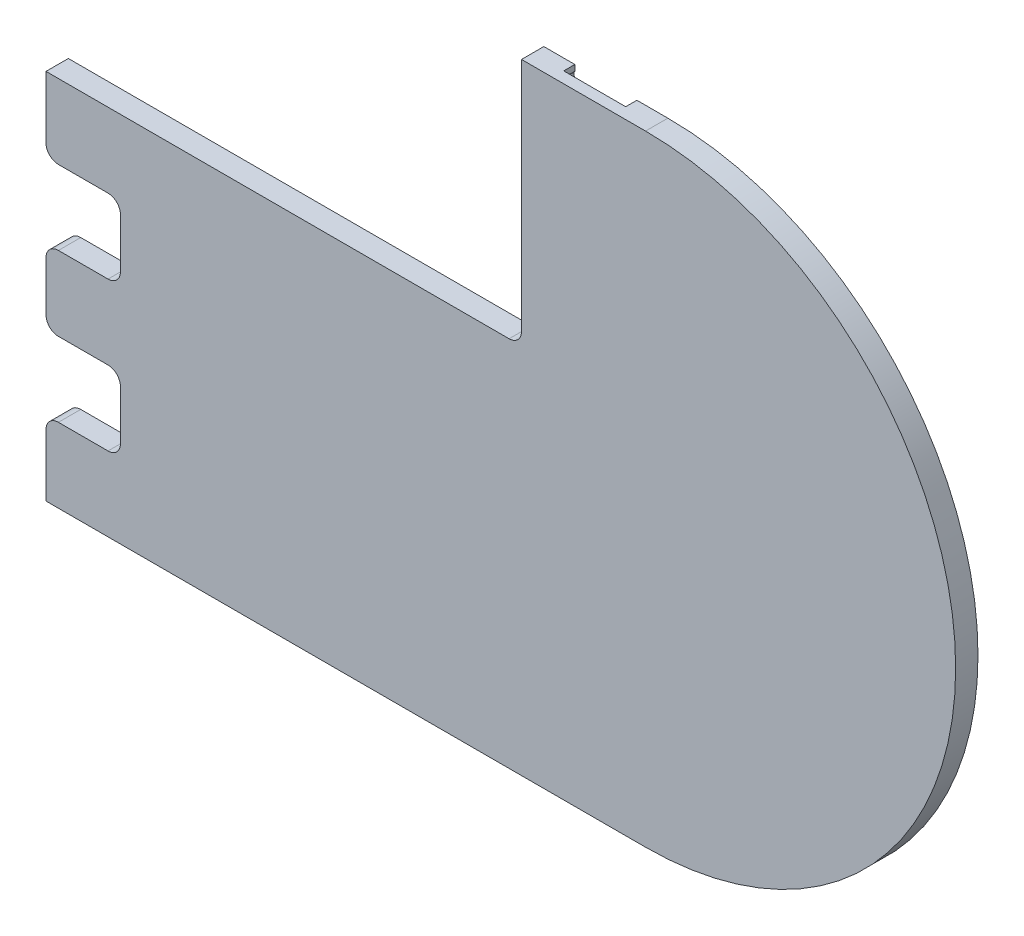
from build123d import *

# Parameters (mm, degrees)
BOSS_EXTRU_1_DEPTH           = 18
ENL_V_MAT_EXTRU_1_DEPTH      = 1129.195018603
ENL_V_MAT_EXTRU_1_DEPTH_BACK = 18
ENL_V_MAT_EXTRU_2_DEPTH      = 30
CONG_3_R                     = 10
ENL_V_MAT_EXTRU_4_DEPTH      = 9
R_P_TITION_LIN_AIRE2_COUNT   = 3
R_P_TITION_LIN_AIRE2_PITCH   = 120
CONG_1_R                     = 10
ENL_V_MAT_EXTRU_5_DEPTH      = 9
ESQUISSE10_W                 = 50
ESQUISSE10_H                 = 36
ENL_V_MAT_EXTRU_6_DEPTH      = 9


with BuildPart() as part:
    # Esquisse1 → Boss.-Extru.1 (new body)
    with BuildSketch(Plane.XY):
        with BuildLine():
            Line((-850, -250), (850, -250))
            ThreePointArc((850, -250), (1100, 0), (850, 250))
            Line((850, 250), (-850, 250))
            ThreePointArc((-850, 250), (-1100, 0), (-850, -250))
        make_face()
    extrude(amount=BOSS_EXTRU_1_DEPTH)

    # Esquisse2 → Enl_v. mat.-Extru.1 (cut, two sides: drawn at the far end of the back side and taken through both)
    with BuildSketch(Plane.XY.offset(18).offset(-ENL_V_MAT_EXTRU_1_DEPTH_BACK)):
        Polygon((-750, 4092.753579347), (-750, 250), (-750, 50), (750, 50), (750, 250), (750, 4092.753579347), (750, 11778.260738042), (-750, 11778.260738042), align=None)
    extrude(amount=ENL_V_MAT_EXTRU_1_DEPTH + ENL_V_MAT_EXTRU_1_DEPTH_BACK, mode=Mode.SUBTRACT)

    # Esquisse5 → Enl_v. mat.-Extru.2 (cut)
    with BuildSketch(Plane(origin=(0, 0, 0), x_dir=(-1, 0, 0), z_dir=(0, 0, -1))):
        Polygon((0, 50), (-366.666666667, 50), (-366.666666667, -10), (-426.666666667, -10), (-426.666666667, -70), (-366.666666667, -70), (-366.666666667, -130), (-426.666666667, -130), (-426.666666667, -190), (-366.666666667, -190), (-366.666666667, -250), (0, -250), align=None)
        Polygon((366.666666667, 50), (0, 50), (0, -250), (366.666666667, -250), (366.666666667, -190), (426.666666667, -190), (426.666666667, -130), (366.666666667, -130), (366.666666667, -70), (426.666666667, -70), (426.666666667, -10), (366.666666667, -10), align=None)
        with BuildLine():
            Line((750, 50), (366.666666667, 50))
            Line((366.666666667, 50), (366.666666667, -10))
            Line((366.666666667, -10), (426.666666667, -10))
            Line((426.666666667, -10), (426.666666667, -70))
            Line((426.666666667, -70), (366.666666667, -70))
            Line((366.666666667, -70), (366.666666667, -130))
            Line((366.666666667, -130), (426.666666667, -130))
            Line((426.666666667, -130), (426.666666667, -190))
            Line((426.666666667, -190), (366.666666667, -190))
            Line((366.666666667, -190), (366.666666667, -250))
            Line((366.666666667, -250), (850, -250))
            ThreePointArc((850, -250), (1100, 0), (850, 250))
            Line((850, 250), (750, 250))
            Line((750, 250), (750, 50))
        make_face()
    extrude(amount=-ENL_V_MAT_EXTRU_2_DEPTH, mode=Mode.SUBTRACT)

    # Cong_3
    cong_3_edges = [part.edges().sort_by_distance(p)[0] for p in [
        (366.666666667, -190, 9),
        (426.666666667, -190, 9),
        (426.666666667, -130, 9),
        (366.666666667, -130, 9),
        (366.666666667, -70, 9),
        (426.666666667, -70, 9),
        (426.666666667, -10, 9),
        (366.666666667, -10, 9),
    ]]
    fillet(cong_3_edges, radius=CONG_3_R)

    # Esquisse7 → Enl_v. mat.-Extru.4 (cut)
    with BuildSketch(Plane(origin=(0, 0, 0), x_dir=(-1, 0, 0), z_dir=(0, 0, -1))):
        with BuildLine():
            Line((-401.42402598, 8), (-391.909307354, 8))
            ThreePointArc((-391.909307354, 8), (-387.666666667, 8), (-387.666666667, 12.242640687))
            Line((-387.666666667, 12.242640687), (-387.666666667, 27.757359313))
            ThreePointArc((-387.666666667, 27.757359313), (-387.666666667, 32), (-391.909307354, 32))
            Line((-391.909307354, 32), (-401.42402598, 32))
            ThreePointArc((-401.42402598, 32), (-405.666666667, 32), (-405.666666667, 27.757359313))
            Line((-405.666666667, 27.757359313), (-405.666666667, 12.242640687))
            ThreePointArc((-405.666666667, 12.242640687), (-405.666666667, 8), (-401.42402598, 8))
        make_face()
    enl_v_mat_extru_4 = extrude(amount=-ENL_V_MAT_EXTRU_4_DEPTH, mode=Mode.SUBTRACT)

    # R_p_tition lin_aire2: Enl_v. mat.-Extru.4 ×3
    with Locations(*[(0, -i * R_P_TITION_LIN_AIRE2_PITCH, 0) for i in range(1, R_P_TITION_LIN_AIRE2_COUNT)]):
        add(enl_v_mat_extru_4, mode=Mode.SUBTRACT)

    # Cong_1
    cong_1_edges = [part.edges().sort_by_distance(p)[0] for p in [
        (750, 50, 9),
    ]]
    fillet(cong_1_edges, radius=CONG_1_R)

    # Esquisse9 → Enl_v. mat.-Extru.5 (cut)
    with BuildSketch(Plane(origin=(0, 0, 0), x_dir=(-1, 0, 0), z_dir=(0, 0, -1))):
        with BuildLine():
            Line((-825, 259), (-775, 259))
            Line((-775, 259), (-775, 245.242640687))
            ThreePointArc((-775, 245.242640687), (-775, 241), (-779.242640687, 241))
            Line((-779.242640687, 241), (-820.757359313, 241))
            ThreePointArc((-820.757359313, 241), (-825, 241), (-825, 245.242640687))
            Line((-825, 245.242640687), (-825, 259))
        make_face()
    extrude(amount=-ENL_V_MAT_EXTRU_5_DEPTH, mode=Mode.SUBTRACT)

    # Esquisse10 → Enl_v. mat.-Extru.6 (cut)
    with BuildSketch(Plane(origin=(0, 0, 0), x_dir=(-1, 0, 0), z_dir=(0, 0, -1))):
        with Locations((-800, -250)):
            Rectangle(ESQUISSE10_W, ESQUISSE10_H)
    extrude(amount=-ENL_V_MAT_EXTRU_6_DEPTH, mode=Mode.SUBTRACT)


solid = part.part
